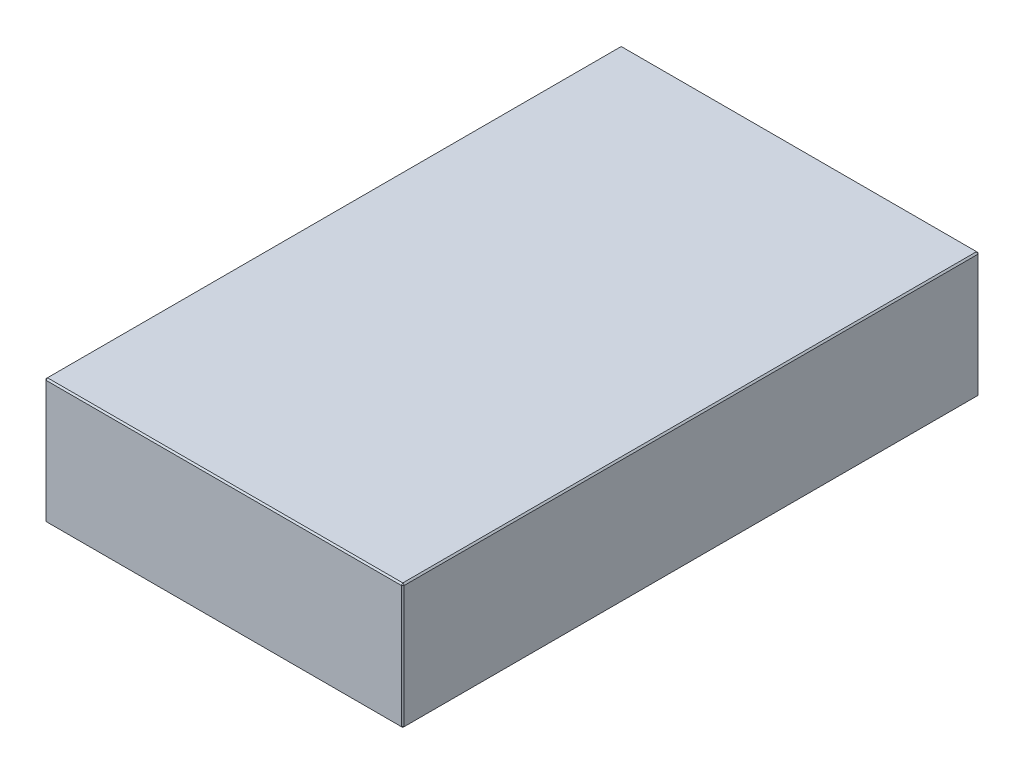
ISO-10303-21;
HEADER;
FILE_DESCRIPTION(('STEP AP214'),'2;1');
FILE_NAME('part.step','',(''),(''),'','','');
FILE_SCHEMA(('AUTOMOTIVE_DESIGN { 1 0 10303 214 1 1 1 1 }'));
ENDSEC;
DATA;
#1=APPLICATION_CONTEXT('core data for automotive mechanical design processes');
#2=APPLICATION_PROTOCOL_DEFINITION('international standard','automotive_design',2000,#1);
#3=PRODUCT_CONTEXT('',#1,'mechanical');
#4=PRODUCT('Part','Part','',(#3));
#5=PRODUCT_RELATED_PRODUCT_CATEGORY('part','',(#4));
#6=PRODUCT_DEFINITION_FORMATION('','',#4);
#7=PRODUCT_DEFINITION_CONTEXT('part definition',#1,'design');
#8=PRODUCT_DEFINITION('design','',#6,#7);
#9=PRODUCT_DEFINITION_SHAPE('','',#8);
#10=(LENGTH_UNIT() NAMED_UNIT(*) SI_UNIT(.MILLI.,.METRE.));
#11=(NAMED_UNIT(*) PLANE_ANGLE_UNIT() SI_UNIT($,.RADIAN.));
#12=(NAMED_UNIT(*) SI_UNIT($,.STERADIAN.) SOLID_ANGLE_UNIT());
#13=UNCERTAINTY_MEASURE_WITH_UNIT(LENGTH_MEASURE(1.E-05),#10,'distance_accuracy_value','');
#14=(GEOMETRIC_REPRESENTATION_CONTEXT(3) GLOBAL_UNCERTAINTY_ASSIGNED_CONTEXT((#13)) GLOBAL_UNIT_ASSIGNED_CONTEXT((#10,
#11,#12)) REPRESENTATION_CONTEXT('',''));
#15=CARTESIAN_POINT('',(0.,0.,0.));
#16=DIRECTION('',(0.,0.,1.));
#17=DIRECTION('',(1.,0.,0.));
#18=AXIS2_PLACEMENT_3D('',#15,#16,#17);
#19=CARTESIAN_POINT('',(-123.,86.,198.));
#20=DIRECTION('',(1.,0.,0.));
#21=DIRECTION('',(0.,0.,-1.));
#22=AXIS2_PLACEMENT_3D('',#19,#20,#21);
#23=PLANE('',#22);
#24=DIRECTION('',(0.,-1.,0.));
#25=VECTOR('',#24,1.);
#26=CARTESIAN_POINT('',(-123.,86.,-197.));
#27=LINE('',#26,#25);
#28=CARTESIAN_POINT('',(-123.,85.,-197.));
#29=VERTEX_POINT('',#28);
#30=CARTESIAN_POINT('',(-123.,1.00000000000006,-197.));
#31=VERTEX_POINT('',#30);
#32=EDGE_CURVE('E114',#29,#31,#27,.T.);
#33=ORIENTED_EDGE('',*,*,#32,.T.);
#34=DIRECTION('',(0.,0.,1.));
#35=VECTOR('',#34,1.);
#36=CARTESIAN_POINT('',(-123.,1.00000000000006,198.));
#37=LINE('',#36,#35);
#38=CARTESIAN_POINT('',(-123.,1.00000000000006,197.));
#39=VERTEX_POINT('',#38);
#40=EDGE_CURVE('E110',#31,#39,#37,.T.);
#41=ORIENTED_EDGE('',*,*,#40,.T.);
#42=DIRECTION('',(0.,1.,0.));
#43=VECTOR('',#42,1.);
#44=CARTESIAN_POINT('',(-123.,86.,197.));
#45=LINE('',#44,#43);
#46=CARTESIAN_POINT('',(-123.,85.,197.));
#47=VERTEX_POINT('',#46);
#48=EDGE_CURVE('E103',#39,#47,#45,.T.);
#49=ORIENTED_EDGE('',*,*,#48,.T.);
#50=DIRECTION('',(0.,0.,-1.));
#51=VECTOR('',#50,1.);
#52=CARTESIAN_POINT('',(-123.,85.,-198.));
#53=LINE('',#52,#51);
#54=EDGE_CURVE('E107',#47,#29,#53,.T.);
#55=ORIENTED_EDGE('',*,*,#54,.T.);
#56=EDGE_LOOP('',(#33,#41,#49,#55));
#57=FACE_BOUND('',#56,.T.);
#58=ADVANCED_FACE('F15',(#57),#23,.F.);
#59=CARTESIAN_POINT('',(123.,86.,198.));
#60=DIRECTION('',(0.,0.,-1.));
#61=DIRECTION('',(-1.,0.,0.));
#62=AXIS2_PLACEMENT_3D('',#59,#60,#61);
#63=PLANE('',#62);
#64=DIRECTION('',(-1.,0.,0.));
#65=VECTOR('',#64,1.);
#66=CARTESIAN_POINT('',(-123.,85.,198.));
#67=LINE('',#66,#65);
#68=CARTESIAN_POINT('',(122.,85.,198.));
#69=VERTEX_POINT('',#68);
#70=CARTESIAN_POINT('',(-122.,85.,198.));
#71=VERTEX_POINT('',#70);
#72=EDGE_CURVE('E164',#69,#71,#67,.T.);
#73=ORIENTED_EDGE('',*,*,#72,.T.);
#74=DIRECTION('',(0.,-1.,0.));
#75=VECTOR('',#74,1.);
#76=CARTESIAN_POINT('',(-122.,86.,198.));
#77=LINE('',#76,#75);
#78=CARTESIAN_POINT('',(-122.,1.00000000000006,198.));
#79=VERTEX_POINT('',#78);
#80=EDGE_CURVE('E122',#71,#79,#77,.T.);
#81=ORIENTED_EDGE('',*,*,#80,.T.);
#82=DIRECTION('',(1.,0.,0.));
#83=VECTOR('',#82,1.);
#84=CARTESIAN_POINT('',(123.,1.00000000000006,198.));
#85=LINE('',#84,#83);
#86=CARTESIAN_POINT('',(122.,1.00000000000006,198.));
#87=VERTEX_POINT('',#86);
#88=EDGE_CURVE('E168',#79,#87,#85,.T.);
#89=ORIENTED_EDGE('',*,*,#88,.T.);
#90=DIRECTION('',(0.,1.,0.));
#91=VECTOR('',#90,1.);
#92=CARTESIAN_POINT('',(122.,86.,198.));
#93=LINE('',#92,#91);
#94=EDGE_CURVE('E166',#87,#69,#93,.T.);
#95=ORIENTED_EDGE('',*,*,#94,.T.);
#96=EDGE_LOOP('',(#73,#81,#89,#95));
#97=FACE_BOUND('',#96,.T.);
#98=ADVANCED_FACE('F275',(#97),#63,.F.);
#99=CARTESIAN_POINT('',(123.,86.,198.));
#100=DIRECTION('',(-1.,0.,0.));
#101=DIRECTION('',(0.,0.,1.));
#102=AXIS2_PLACEMENT_3D('',#99,#100,#101);
#103=PLANE('',#102);
#104=DIRECTION('',(0.,0.,-1.));
#105=VECTOR('',#104,1.);
#106=CARTESIAN_POINT('',(123.,1.00000000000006,198.));
#107=LINE('',#106,#105);
#108=CARTESIAN_POINT('',(123.,1.00000000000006,197.));
#109=VERTEX_POINT('',#108);
#110=CARTESIAN_POINT('',(123.,1.00000000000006,-197.));
#111=VERTEX_POINT('',#110);
#112=EDGE_CURVE('E159',#109,#111,#107,.T.);
#113=ORIENTED_EDGE('',*,*,#112,.T.);
#114=DIRECTION('',(0.,1.,0.));
#115=VECTOR('',#114,1.);
#116=CARTESIAN_POINT('',(123.,86.,-197.));
#117=LINE('',#116,#115);
#118=CARTESIAN_POINT('',(123.,85.,-197.));
#119=VERTEX_POINT('',#118);
#120=EDGE_CURVE('E161',#111,#119,#117,.T.);
#121=ORIENTED_EDGE('',*,*,#120,.T.);
#122=DIRECTION('',(0.,0.,1.));
#123=VECTOR('',#122,1.);
#124=CARTESIAN_POINT('',(123.,85.,198.));
#125=LINE('',#124,#123);
#126=CARTESIAN_POINT('',(123.,85.,197.));
#127=VERTEX_POINT('',#126);
#128=EDGE_CURVE('E155',#119,#127,#125,.T.);
#129=ORIENTED_EDGE('',*,*,#128,.T.);
#130=DIRECTION('',(0.,-1.,0.));
#131=VECTOR('',#130,1.);
#132=CARTESIAN_POINT('',(123.,86.,197.));
#133=LINE('',#132,#131);
#134=EDGE_CURVE('E157',#127,#109,#133,.T.);
#135=ORIENTED_EDGE('',*,*,#134,.T.);
#136=EDGE_LOOP('',(#113,#121,#129,#135));
#137=FACE_BOUND('',#136,.T.);
#138=ADVANCED_FACE('F254',(#137),#103,.F.);
#139=CARTESIAN_POINT('',(123.,86.,-198.));
#140=DIRECTION('',(0.,0.,1.));
#141=DIRECTION('',(1.,0.,0.));
#142=AXIS2_PLACEMENT_3D('',#139,#140,#141);
#143=PLANE('',#142);
#144=DIRECTION('',(0.,-1.,0.));
#145=VECTOR('',#144,1.);
#146=CARTESIAN_POINT('',(122.,86.,-198.));
#147=LINE('',#146,#145);
#148=CARTESIAN_POINT('',(122.,85.,-198.));
#149=VERTEX_POINT('',#148);
#150=CARTESIAN_POINT('',(122.,1.00000000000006,-198.));
#151=VERTEX_POINT('',#150);
#152=EDGE_CURVE('E148',#149,#151,#147,.T.);
#153=ORIENTED_EDGE('',*,*,#152,.T.);
#154=DIRECTION('',(-1.,0.,0.));
#155=VECTOR('',#154,1.);
#156=CARTESIAN_POINT('',(123.,1.00000000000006,-198.));
#157=LINE('',#156,#155);
#158=CARTESIAN_POINT('',(-122.,1.00000000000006,-198.));
#159=VERTEX_POINT('',#158);
#160=EDGE_CURVE('E153',#151,#159,#157,.T.);
#161=ORIENTED_EDGE('',*,*,#160,.T.);
#162=DIRECTION('',(0.,1.,0.));
#163=VECTOR('',#162,1.);
#164=CARTESIAN_POINT('',(-122.,86.,-198.));
#165=LINE('',#164,#163);
#166=CARTESIAN_POINT('',(-122.,85.,-198.));
#167=VERTEX_POINT('',#166);
#168=EDGE_CURVE('E150',#159,#167,#165,.T.);
#169=ORIENTED_EDGE('',*,*,#168,.T.);
#170=DIRECTION('',(1.,0.,0.));
#171=VECTOR('',#170,1.);
#172=CARTESIAN_POINT('',(123.,85.,-198.));
#173=LINE('',#172,#171);
#174=EDGE_CURVE('E146',#167,#149,#173,.T.);
#175=ORIENTED_EDGE('',*,*,#174,.T.);
#176=EDGE_LOOP('',(#153,#161,#169,#175));
#177=FACE_BOUND('',#176,.T.);
#178=ADVANCED_FACE('F284',(#177),#143,.F.);
#179=CARTESIAN_POINT('',(0.,86.,0.));
#180=DIRECTION('',(0.,1.,0.));
#181=DIRECTION('',(0.,0.,1.));
#182=AXIS2_PLACEMENT_3D('',#179,#180,#181);
#183=PLANE('',#182);
#184=DIRECTION('',(0.,0.,-1.));
#185=VECTOR('',#184,1.);
#186=CARTESIAN_POINT('',(122.,86.,-198.));
#187=LINE('',#186,#185);
#188=CARTESIAN_POINT('',(122.,86.,197.));
#189=VERTEX_POINT('',#188);
#190=CARTESIAN_POINT('',(122.,86.,-197.));
#191=VERTEX_POINT('',#190);
#192=EDGE_CURVE('E24',#189,#191,#187,.T.);
#193=ORIENTED_EDGE('',*,*,#192,.T.);
#194=DIRECTION('',(-1.,0.,0.));
#195=VECTOR('',#194,1.);
#196=CARTESIAN_POINT('',(-123.,86.,-197.));
#197=LINE('',#196,#195);
#198=CARTESIAN_POINT('',(-122.,86.,-197.));
#199=VERTEX_POINT('',#198);
#200=EDGE_CURVE('E9',#191,#199,#197,.T.);
#201=ORIENTED_EDGE('',*,*,#200,.T.);
#202=DIRECTION('',(0.,0.,1.));
#203=VECTOR('',#202,1.);
#204=CARTESIAN_POINT('',(-122.,86.,198.));
#205=LINE('',#204,#203);
#206=CARTESIAN_POINT('',(-122.,86.,197.));
#207=VERTEX_POINT('',#206);
#208=EDGE_CURVE('E180',#199,#207,#205,.T.);
#209=ORIENTED_EDGE('',*,*,#208,.T.);
#210=DIRECTION('',(1.,0.,0.));
#211=VECTOR('',#210,1.);
#212=CARTESIAN_POINT('',(123.,86.,197.));
#213=LINE('',#212,#211);
#214=EDGE_CURVE('E35',#207,#189,#213,.T.);
#215=ORIENTED_EDGE('',*,*,#214,.T.);
#216=EDGE_LOOP('',(#193,#201,#209,#215));
#217=FACE_BOUND('',#216,.T.);
#218=ADVANCED_FACE('F350',(#217),#183,.T.);
#219=CARTESIAN_POINT('',(0.,0.,0.));
#220=DIRECTION('',(0.,1.,0.));
#221=DIRECTION('',(0.,0.,1.));
#222=AXIS2_PLACEMENT_3D('',#219,#220,#221);
#223=PLANE('',#222);
#224=DIRECTION('',(0.,0.,1.));
#225=VECTOR('',#224,1.);
#226=CARTESIAN_POINT('',(122.,0.,0.));
#227=LINE('',#226,#225);
#228=CARTESIAN_POINT('',(122.,0.,-197.));
#229=VERTEX_POINT('',#228);
#230=CARTESIAN_POINT('',(122.,0.,197.));
#231=VERTEX_POINT('',#230);
#232=EDGE_CURVE('E171',#229,#231,#227,.T.);
#233=ORIENTED_EDGE('',*,*,#232,.T.);
#234=DIRECTION('',(-1.,0.,0.));
#235=VECTOR('',#234,1.);
#236=CARTESIAN_POINT('',(0.,0.,197.));
#237=LINE('',#236,#235);
#238=CARTESIAN_POINT('',(-122.,0.,197.));
#239=VERTEX_POINT('',#238);
#240=EDGE_CURVE('E177',#231,#239,#237,.T.);
#241=ORIENTED_EDGE('',*,*,#240,.T.);
#242=DIRECTION('',(0.,0.,-1.));
#243=VECTOR('',#242,1.);
#244=CARTESIAN_POINT('',(-122.,0.,0.));
#245=LINE('',#244,#243);
#246=CARTESIAN_POINT('',(-122.,0.,-197.));
#247=VERTEX_POINT('',#246);
#248=EDGE_CURVE('E175',#239,#247,#245,.T.);
#249=ORIENTED_EDGE('',*,*,#248,.T.);
#250=DIRECTION('',(1.,0.,0.));
#251=VECTOR('',#250,1.);
#252=CARTESIAN_POINT('',(0.,0.,-197.));
#253=LINE('',#252,#251);
#254=EDGE_CURVE('E173',#247,#229,#253,.T.);
#255=ORIENTED_EDGE('',*,*,#254,.T.);
#256=EDGE_LOOP('',(#233,#241,#249,#255));
#257=FACE_BOUND('',#256,.T.);
#258=ADVANCED_FACE('F246',(#257),#223,.F.);
#259=CARTESIAN_POINT('',(123.,86.,197.));
#260=DIRECTION('',(-0.707106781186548,0.,-0.707106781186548));
#261=DIRECTION('',(0.,-1.,0.));
#262=AXIS2_PLACEMENT_3D('',#259,#260,#261);
#263=PLANE('',#262);
#264=DIRECTION('',(-0.707106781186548,0.,0.707106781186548));
#265=VECTOR('',#264,1.);
#266=CARTESIAN_POINT('',(122.,85.,198.));
#267=LINE('',#266,#265);
#268=EDGE_CURVE('E19',#69,#127,#267,.F.);
#269=ORIENTED_EDGE('',*,*,#268,.F.);
#270=ORIENTED_EDGE('',*,*,#94,.F.);
#271=DIRECTION('',(0.707106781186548,0.,-0.707106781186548));
#272=VECTOR('',#271,1.);
#273=CARTESIAN_POINT('',(122.,1.00000000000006,198.));
#274=LINE('',#273,#272);
#275=EDGE_CURVE('E142',#109,#87,#274,.F.);
#276=ORIENTED_EDGE('',*,*,#275,.F.);
#277=ORIENTED_EDGE('',*,*,#134,.F.);
#278=EDGE_LOOP('',(#269,#270,#276,#277));
#279=FACE_BOUND('',#278,.T.);
#280=ADVANCED_FACE('F17',(#279),#263,.F.);
#281=CARTESIAN_POINT('',(122.,85.,198.));
#282=DIRECTION('',(0.577350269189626,0.577350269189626,0.577350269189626));
#283=DIRECTION('',(0.707106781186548,0.,-0.707106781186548));
#284=AXIS2_PLACEMENT_3D('',#281,#282,#283);
#285=PLANE('',#284);
#286=DIRECTION('',(0.,-0.707106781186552,0.707106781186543));
#287=VECTOR('',#286,1.);
#288=CARTESIAN_POINT('',(122.,85.,198.));
#289=LINE('',#288,#287);
#290=EDGE_CURVE('E226',#69,#189,#289,.F.);
#291=ORIENTED_EDGE('',*,*,#290,.F.);
#292=ORIENTED_EDGE('',*,*,#268,.T.);
#293=DIRECTION('',(-0.707106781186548,0.707106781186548,0.));
#294=VECTOR('',#293,1.);
#295=CARTESIAN_POINT('',(122.5,85.5,197.));
#296=LINE('',#295,#294);
#297=EDGE_CURVE('E228',#189,#127,#296,.F.);
#298=ORIENTED_EDGE('',*,*,#297,.F.);
#299=EDGE_LOOP('',(#291,#292,#298));
#300=FACE_BOUND('',#299,.T.);
#301=ADVANCED_FACE('F270',(#300),#285,.T.);
#302=CARTESIAN_POINT('',(122.,1.00000000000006,198.));
#303=DIRECTION('',(0.577350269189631,-0.577350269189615,0.577350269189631));
#304=DIRECTION('',(0.707106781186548,0.,-0.707106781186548));
#305=AXIS2_PLACEMENT_3D('',#302,#303,#304);
#306=PLANE('',#305);
#307=DIRECTION('',(-0.707106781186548,-0.707106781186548,0.));
#308=VECTOR('',#307,1.);
#309=CARTESIAN_POINT('',(122.5,0.500000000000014,197.));
#310=LINE('',#309,#308);
#311=EDGE_CURVE('E220',#109,#231,#310,.T.);
#312=ORIENTED_EDGE('',*,*,#311,.F.);
#313=ORIENTED_EDGE('',*,*,#275,.T.);
#314=DIRECTION('',(0.,0.707106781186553,0.707106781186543));
#315=VECTOR('',#314,1.);
#316=CARTESIAN_POINT('',(122.,1.00000000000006,198.));
#317=LINE('',#316,#315);
#318=EDGE_CURVE('E223',#231,#87,#317,.T.);
#319=ORIENTED_EDGE('',*,*,#318,.F.);
#320=EDGE_LOOP('',(#312,#313,#319));
#321=FACE_BOUND('',#320,.T.);
#322=ADVANCED_FACE('F235',(#321),#306,.T.);
#323=CARTESIAN_POINT('',(122.,86.,0.));
#324=DIRECTION('',(0.707106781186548,0.707106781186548,0.));
#325=DIRECTION('',(0.,0.,1.));
#326=AXIS2_PLACEMENT_3D('',#323,#324,#325);
#327=PLANE('',#326);
#328=ORIENTED_EDGE('',*,*,#297,.T.);
#329=ORIENTED_EDGE('',*,*,#128,.F.);
#330=DIRECTION('',(0.707106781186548,-0.707106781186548,0.));
#331=VECTOR('',#330,1.);
#332=CARTESIAN_POINT('',(123.,85.,-197.));
#333=LINE('',#332,#331);
#334=EDGE_CURVE('E215',#191,#119,#333,.T.);
#335=ORIENTED_EDGE('',*,*,#334,.F.);
#336=ORIENTED_EDGE('',*,*,#192,.F.);
#337=EDGE_LOOP('',(#328,#329,#335,#336));
#338=FACE_BOUND('',#337,.T.);
#339=ADVANCED_FACE('F265',(#338),#327,.T.);
#340=CARTESIAN_POINT('',(0.,86.,197.));
#341=DIRECTION('',(0.,0.707106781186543,0.707106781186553));
#342=DIRECTION('',(-1.,0.,0.));
#343=AXIS2_PLACEMENT_3D('',#340,#341,#342);
#344=PLANE('',#343);
#345=ORIENTED_EDGE('',*,*,#290,.T.);
#346=ORIENTED_EDGE('',*,*,#214,.F.);
#347=DIRECTION('',(0.,0.707106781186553,-0.707106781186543));
#348=VECTOR('',#347,1.);
#349=CARTESIAN_POINT('',(-122.,85.5,197.5));
#350=LINE('',#349,#348);
#351=EDGE_CURVE('E126',#71,#207,#350,.T.);
#352=ORIENTED_EDGE('',*,*,#351,.F.);
#353=ORIENTED_EDGE('',*,*,#72,.F.);
#354=EDGE_LOOP('',(#345,#346,#352,#353));
#355=FACE_BOUND('',#354,.T.);
#356=ADVANCED_FACE('F273',(#355),#344,.T.);
#357=CARTESIAN_POINT('',(-122.,86.,198.));
#358=DIRECTION('',(0.707106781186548,0.,-0.707106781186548));
#359=DIRECTION('',(0.,-1.,0.));
#360=AXIS2_PLACEMENT_3D('',#357,#358,#359);
#361=PLANE('',#360);
#362=DIRECTION('',(0.707106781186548,0.,0.707106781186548));
#363=VECTOR('',#362,1.);
#364=CARTESIAN_POINT('',(-122.,1.00000000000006,198.));
#365=LINE('',#364,#363);
#366=EDGE_CURVE('E127',#79,#39,#365,.F.);
#367=ORIENTED_EDGE('',*,*,#366,.F.);
#368=ORIENTED_EDGE('',*,*,#80,.F.);
#369=DIRECTION('',(-0.707106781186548,0.,-0.707106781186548));
#370=VECTOR('',#369,1.);
#371=CARTESIAN_POINT('',(-123.,85.,197.));
#372=LINE('',#371,#370);
#373=EDGE_CURVE('E118',#47,#71,#372,.F.);
#374=ORIENTED_EDGE('',*,*,#373,.F.);
#375=ORIENTED_EDGE('',*,*,#48,.F.);
#376=EDGE_LOOP('',(#367,#368,#374,#375));
#377=FACE_BOUND('',#376,.T.);
#378=ADVANCED_FACE('F120',(#377),#361,.F.);
#379=CARTESIAN_POINT('',(123.,1.00000000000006,198.));
#380=DIRECTION('',(0.,0.707106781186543,-0.707106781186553));
#381=DIRECTION('',(1.,0.,0.));
#382=AXIS2_PLACEMENT_3D('',#379,#380,#381);
#383=PLANE('',#382);
#384=ORIENTED_EDGE('',*,*,#318,.T.);
#385=ORIENTED_EDGE('',*,*,#88,.F.);
#386=DIRECTION('',(0.,-0.707106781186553,-0.707106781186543));
#387=VECTOR('',#386,1.);
#388=CARTESIAN_POINT('',(-122.,1.00000000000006,198.));
#389=LINE('',#388,#387);
#390=EDGE_CURVE('E211',#239,#79,#389,.F.);
#391=ORIENTED_EDGE('',*,*,#390,.F.);
#392=ORIENTED_EDGE('',*,*,#240,.F.);
#393=EDGE_LOOP('',(#384,#385,#391,#392));
#394=FACE_BOUND('',#393,.T.);
#395=ADVANCED_FACE('F243',(#394),#383,.F.);
#396=CARTESIAN_POINT('',(123.,1.00000000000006,198.));
#397=DIRECTION('',(-0.707106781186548,0.707106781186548,0.));
#398=DIRECTION('',(0.,0.,-1.));
#399=AXIS2_PLACEMENT_3D('',#396,#397,#398);
#400=PLANE('',#399);
#401=ORIENTED_EDGE('',*,*,#311,.T.);
#402=ORIENTED_EDGE('',*,*,#232,.F.);
#403=DIRECTION('',(0.707106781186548,0.707106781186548,0.));
#404=VECTOR('',#403,1.);
#405=CARTESIAN_POINT('',(122.5,0.500000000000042,-197.));
#406=LINE('',#405,#404);
#407=EDGE_CURVE('E208',#111,#229,#406,.F.);
#408=ORIENTED_EDGE('',*,*,#407,.F.);
#409=ORIENTED_EDGE('',*,*,#112,.F.);
#410=EDGE_LOOP('',(#401,#402,#408,#409));
#411=FACE_BOUND('',#410,.T.);
#412=ADVANCED_FACE('F251',(#411),#400,.F.);
#413=CARTESIAN_POINT('',(122.,86.,-198.));
#414=DIRECTION('',(-0.707106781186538,0.,0.707106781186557));
#415=DIRECTION('',(0.,-1.,0.));
#416=AXIS2_PLACEMENT_3D('',#413,#414,#415);
#417=PLANE('',#416);
#418=DIRECTION('',(0.707106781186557,0.,0.707106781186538));
#419=VECTOR('',#418,1.);
#420=CARTESIAN_POINT('',(123.,85.,-197.));
#421=LINE('',#420,#419);
#422=EDGE_CURVE('E217',#119,#149,#421,.F.);
#423=ORIENTED_EDGE('',*,*,#422,.F.);
#424=ORIENTED_EDGE('',*,*,#120,.F.);
#425=DIRECTION('',(-0.707106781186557,0.,-0.707106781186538));
#426=VECTOR('',#425,1.);
#427=CARTESIAN_POINT('',(122.,1.00000000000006,-198.));
#428=LINE('',#427,#426);
#429=EDGE_CURVE('E205',#151,#111,#428,.F.);
#430=ORIENTED_EDGE('',*,*,#429,.F.);
#431=ORIENTED_EDGE('',*,*,#152,.F.);
#432=EDGE_LOOP('',(#423,#424,#430,#431));
#433=FACE_BOUND('',#432,.T.);
#434=ADVANCED_FACE('F258',(#433),#417,.F.);
#435=CARTESIAN_POINT('',(123.,85.,-197.));
#436=DIRECTION('',(0.577350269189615,0.577350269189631,-0.577350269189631));
#437=DIRECTION('',(0.,0.707106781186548,0.707106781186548));
#438=AXIS2_PLACEMENT_3D('',#435,#436,#437);
#439=PLANE('',#438);
#440=ORIENTED_EDGE('',*,*,#334,.T.);
#441=ORIENTED_EDGE('',*,*,#422,.T.);
#442=DIRECTION('',(0.,0.707106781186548,0.707106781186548));
#443=VECTOR('',#442,1.);
#444=CARTESIAN_POINT('',(122.,85.5,-197.5));
#445=LINE('',#444,#443);
#446=EDGE_CURVE('E134',#191,#149,#445,.F.);
#447=ORIENTED_EDGE('',*,*,#446,.F.);
#448=EDGE_LOOP('',(#440,#441,#447));
#449=FACE_BOUND('',#448,.T.);
#450=ADVANCED_FACE('F325',(#449),#439,.T.);
#451=CARTESIAN_POINT('',(-123.,85.,197.));
#452=DIRECTION('',(-0.577350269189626,0.577350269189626,0.577350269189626));
#453=DIRECTION('',(0.707106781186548,0.,0.707106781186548));
#454=AXIS2_PLACEMENT_3D('',#451,#452,#453);
#455=PLANE('',#454);
#456=ORIENTED_EDGE('',*,*,#373,.T.);
#457=ORIENTED_EDGE('',*,*,#351,.T.);
#458=DIRECTION('',(-0.707106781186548,-0.707106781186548,0.));
#459=VECTOR('',#458,1.);
#460=CARTESIAN_POINT('',(-123.,85.,197.));
#461=LINE('',#460,#459);
#462=EDGE_CURVE('E130',#47,#207,#461,.F.);
#463=ORIENTED_EDGE('',*,*,#462,.F.);
#464=EDGE_LOOP('',(#456,#457,#463));
#465=FACE_BOUND('',#464,.T.);
#466=ADVANCED_FACE('F131',(#465),#455,.T.);
#467=CARTESIAN_POINT('',(-122.,1.00000000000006,198.));
#468=DIRECTION('',(-0.577350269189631,-0.577350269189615,0.577350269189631));
#469=DIRECTION('',(0.707106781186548,0.,0.707106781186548));
#470=AXIS2_PLACEMENT_3D('',#467,#468,#469);
#471=PLANE('',#470);
#472=ORIENTED_EDGE('',*,*,#390,.T.);
#473=ORIENTED_EDGE('',*,*,#366,.T.);
#474=DIRECTION('',(-0.707106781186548,0.707106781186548,0.));
#475=VECTOR('',#474,1.);
#476=CARTESIAN_POINT('',(-122.5,0.500000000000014,197.));
#477=LINE('',#476,#475);
#478=EDGE_CURVE('E135',#239,#39,#477,.T.);
#479=ORIENTED_EDGE('',*,*,#478,.F.);
#480=EDGE_LOOP('',(#472,#473,#479));
#481=FACE_BOUND('',#480,.T.);
#482=ADVANCED_FACE('F318',(#481),#471,.T.);
#483=CARTESIAN_POINT('',(122.,1.00000000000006,-198.));
#484=DIRECTION('',(0.577350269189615,-0.577350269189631,-0.577350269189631));
#485=DIRECTION('',(0.,0.707106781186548,-0.707106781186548));
#486=AXIS2_PLACEMENT_3D('',#483,#484,#485);
#487=PLANE('',#486);
#488=ORIENTED_EDGE('',*,*,#429,.T.);
#489=ORIENTED_EDGE('',*,*,#407,.T.);
#490=DIRECTION('',(0.,-0.707106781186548,0.707106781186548));
#491=VECTOR('',#490,1.);
#492=CARTESIAN_POINT('',(122.,1.00000000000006,-198.));
#493=LINE('',#492,#491);
#494=EDGE_CURVE('E198',#151,#229,#493,.T.);
#495=ORIENTED_EDGE('',*,*,#494,.F.);
#496=EDGE_LOOP('',(#488,#489,#495));
#497=FACE_BOUND('',#496,.T.);
#498=ADVANCED_FACE('F314',(#497),#487,.T.);
#499=CARTESIAN_POINT('',(0.,86.,-197.));
#500=DIRECTION('',(0.,0.707106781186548,-0.707106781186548));
#501=DIRECTION('',(1.,0.,0.));
#502=AXIS2_PLACEMENT_3D('',#499,#500,#501);
#503=PLANE('',#502);
#504=ORIENTED_EDGE('',*,*,#446,.T.);
#505=ORIENTED_EDGE('',*,*,#174,.F.);
#506=DIRECTION('',(0.,-0.707106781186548,-0.707106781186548));
#507=VECTOR('',#506,1.);
#508=CARTESIAN_POINT('',(-122.,85.,-198.));
#509=LINE('',#508,#507);
#510=EDGE_CURVE('E195',#199,#167,#509,.T.);
#511=ORIENTED_EDGE('',*,*,#510,.F.);
#512=ORIENTED_EDGE('',*,*,#200,.F.);
#513=EDGE_LOOP('',(#504,#505,#511,#512));
#514=FACE_BOUND('',#513,.T.);
#515=ADVANCED_FACE('F311',(#514),#503,.T.);
#516=CARTESIAN_POINT('',(-122.,86.,0.));
#517=DIRECTION('',(-0.707106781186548,0.707106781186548,0.));
#518=DIRECTION('',(0.,0.,-1.));
#519=AXIS2_PLACEMENT_3D('',#516,#517,#518);
#520=PLANE('',#519);
#521=ORIENTED_EDGE('',*,*,#462,.T.);
#522=ORIENTED_EDGE('',*,*,#208,.F.);
#523=DIRECTION('',(0.707106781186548,0.707106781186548,0.));
#524=VECTOR('',#523,1.);
#525=CARTESIAN_POINT('',(-122.5,85.5,-197.));
#526=LINE('',#525,#524);
#527=EDGE_CURVE('E138',#29,#199,#526,.T.);
#528=ORIENTED_EDGE('',*,*,#527,.F.);
#529=ORIENTED_EDGE('',*,*,#54,.F.);
#530=EDGE_LOOP('',(#521,#522,#528,#529));
#531=FACE_BOUND('',#530,.T.);
#532=ADVANCED_FACE('F137',(#531),#520,.T.);
#533=CARTESIAN_POINT('',(-123.,1.00000000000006,198.));
#534=DIRECTION('',(0.707106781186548,0.707106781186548,0.));
#535=DIRECTION('',(0.,0.,1.));
#536=AXIS2_PLACEMENT_3D('',#533,#534,#535);
#537=PLANE('',#536);
#538=ORIENTED_EDGE('',*,*,#478,.T.);
#539=ORIENTED_EDGE('',*,*,#40,.F.);
#540=DIRECTION('',(0.707106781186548,-0.707106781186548,0.));
#541=VECTOR('',#540,1.);
#542=CARTESIAN_POINT('',(-123.,1.00000000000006,-197.));
#543=LINE('',#542,#541);
#544=EDGE_CURVE('E191',#247,#31,#543,.F.);
#545=ORIENTED_EDGE('',*,*,#544,.F.);
#546=ORIENTED_EDGE('',*,*,#248,.F.);
#547=EDGE_LOOP('',(#538,#539,#545,#546));
#548=FACE_BOUND('',#547,.T.);
#549=ADVANCED_FACE('F304',(#548),#537,.F.);
#550=CARTESIAN_POINT('',(123.,1.00000000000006,-198.));
#551=DIRECTION('',(0.,0.707106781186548,0.707106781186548));
#552=DIRECTION('',(-1.,0.,0.));
#553=AXIS2_PLACEMENT_3D('',#550,#551,#552);
#554=PLANE('',#553);
#555=ORIENTED_EDGE('',*,*,#494,.T.);
#556=ORIENTED_EDGE('',*,*,#254,.F.);
#557=DIRECTION('',(0.,0.707106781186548,-0.707106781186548));
#558=VECTOR('',#557,1.);
#559=CARTESIAN_POINT('',(-122.,0.500000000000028,-197.5));
#560=LINE('',#559,#558);
#561=EDGE_CURVE('E188',#159,#247,#560,.F.);
#562=ORIENTED_EDGE('',*,*,#561,.F.);
#563=ORIENTED_EDGE('',*,*,#160,.F.);
#564=EDGE_LOOP('',(#555,#556,#562,#563));
#565=FACE_BOUND('',#564,.T.);
#566=ADVANCED_FACE('F300',(#565),#554,.F.);
#567=CARTESIAN_POINT('',(-122.,85.,-198.));
#568=DIRECTION('',(-0.577350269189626,0.577350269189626,-0.577350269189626));
#569=DIRECTION('',(-0.707106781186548,0.,0.707106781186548));
#570=AXIS2_PLACEMENT_3D('',#567,#568,#569);
#571=PLANE('',#570);
#572=ORIENTED_EDGE('',*,*,#527,.T.);
#573=ORIENTED_EDGE('',*,*,#510,.T.);
#574=DIRECTION('',(0.707106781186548,0.,-0.707106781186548));
#575=VECTOR('',#574,1.);
#576=CARTESIAN_POINT('',(-122.,85.,-198.));
#577=LINE('',#576,#575);
#578=EDGE_CURVE('E186',#29,#167,#577,.T.);
#579=ORIENTED_EDGE('',*,*,#578,.F.);
#580=EDGE_LOOP('',(#572,#573,#579));
#581=FACE_BOUND('',#580,.T.);
#582=ADVANCED_FACE('F296',(#581),#571,.T.);
#583=CARTESIAN_POINT('',(-123.,1.00000000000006,-197.));
#584=DIRECTION('',(-0.577350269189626,-0.577350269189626,-0.577350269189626));
#585=DIRECTION('',(-0.707106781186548,0.,0.707106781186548));
#586=AXIS2_PLACEMENT_3D('',#583,#584,#585);
#587=PLANE('',#586);
#588=ORIENTED_EDGE('',*,*,#561,.T.);
#589=ORIENTED_EDGE('',*,*,#544,.T.);
#590=DIRECTION('',(-0.707106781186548,0.,0.707106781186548));
#591=VECTOR('',#590,1.);
#592=CARTESIAN_POINT('',(-123.,1.00000000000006,-197.));
#593=LINE('',#592,#591);
#594=EDGE_CURVE('E184',#159,#31,#593,.T.);
#595=ORIENTED_EDGE('',*,*,#594,.F.);
#596=EDGE_LOOP('',(#588,#589,#595));
#597=FACE_BOUND('',#596,.T.);
#598=ADVANCED_FACE('F292',(#597),#587,.T.);
#599=CARTESIAN_POINT('',(-123.,86.,-197.));
#600=DIRECTION('',(0.707106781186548,0.,0.707106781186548));
#601=DIRECTION('',(0.,-1.,0.));
#602=AXIS2_PLACEMENT_3D('',#599,#600,#601);
#603=PLANE('',#602);
#604=ORIENTED_EDGE('',*,*,#578,.T.);
#605=ORIENTED_EDGE('',*,*,#168,.F.);
#606=ORIENTED_EDGE('',*,*,#594,.T.);
#607=ORIENTED_EDGE('',*,*,#32,.F.);
#608=EDGE_LOOP('',(#604,#605,#606,#607));
#609=FACE_BOUND('',#608,.T.);
#610=ADVANCED_FACE('F289',(#609),#603,.F.);
#611=CLOSED_SHELL('',(#58,#98,#138,#178,#218,#258,#280,#301,#322,#339,#356,#378,#395,#412,#434,
#450,#466,#482,#498,#515,#532,#549,#566,#582,#598,#610));
#612=MANIFOLD_SOLID_BREP('B1',#611);
#613=ADVANCED_BREP_SHAPE_REPRESENTATION('',(#18,#612),#14);
#614=SHAPE_DEFINITION_REPRESENTATION(#9,#613);
ENDSEC;
END-ISO-10303-21;
